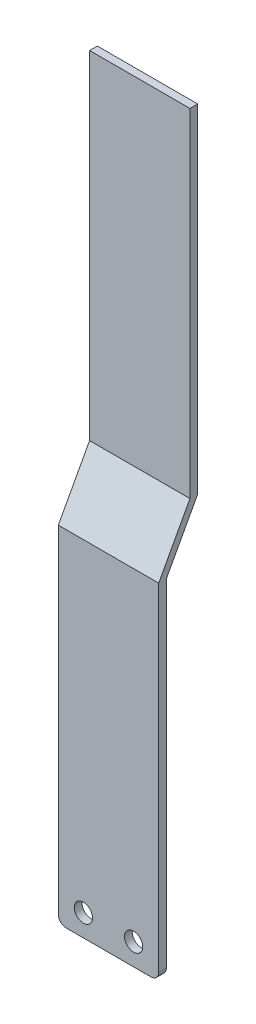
ISO-10303-21;
HEADER;
FILE_DESCRIPTION(('STEP AP214'),'2;1');
FILE_NAME('part.step','',(''),(''),'','','');
FILE_SCHEMA(('AUTOMOTIVE_DESIGN { 1 0 10303 214 1 1 1 1 }'));
ENDSEC;
DATA;
#1=APPLICATION_CONTEXT('core data for automotive mechanical design processes');
#2=APPLICATION_PROTOCOL_DEFINITION('international standard','automotive_design',2000,#1);
#3=PRODUCT_CONTEXT('',#1,'mechanical');
#4=PRODUCT('Part','Part','',(#3));
#5=PRODUCT_RELATED_PRODUCT_CATEGORY('part','',(#4));
#6=PRODUCT_DEFINITION_FORMATION('','',#4);
#7=PRODUCT_DEFINITION_CONTEXT('part definition',#1,'design');
#8=PRODUCT_DEFINITION('design','',#6,#7);
#9=PRODUCT_DEFINITION_SHAPE('','',#8);
#10=(LENGTH_UNIT() NAMED_UNIT(*) SI_UNIT(.MILLI.,.METRE.));
#11=(NAMED_UNIT(*) PLANE_ANGLE_UNIT() SI_UNIT($,.RADIAN.));
#12=(NAMED_UNIT(*) SI_UNIT($,.STERADIAN.) SOLID_ANGLE_UNIT());
#13=UNCERTAINTY_MEASURE_WITH_UNIT(LENGTH_MEASURE(1.E-05),#10,'distance_accuracy_value','');
#14=(GEOMETRIC_REPRESENTATION_CONTEXT(3) GLOBAL_UNCERTAINTY_ASSIGNED_CONTEXT((#13)) GLOBAL_UNIT_ASSIGNED_CONTEXT((#10,
#11,#12)) REPRESENTATION_CONTEXT('',''));
#15=CARTESIAN_POINT('',(0.,0.,0.));
#16=DIRECTION('',(0.,0.,1.));
#17=DIRECTION('',(1.,0.,0.));
#18=AXIS2_PLACEMENT_3D('',#15,#16,#17);
#19=CARTESIAN_POINT('',(14.3366294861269,40.9401523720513,2.54));
#20=DIRECTION('',(0.,0.,1.));
#21=DIRECTION('',(1.,0.,0.));
#22=AXIS2_PLACEMENT_3D('',#19,#20,#21);
#23=PLANE('',#22);
#24=CARTESIAN_POINT('',(-7.87762606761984,45.5871490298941,2.54));
#25=DIRECTION('',(0.,0.,1.));
#26=DIRECTION('',(1.,0.,0.));
#27=AXIS2_PLACEMENT_3D('',#24,#25,#26);
#28=CIRCLE('',#27,2.99251043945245);
#29=CARTESIAN_POINT('',(-4.88511562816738,45.5871490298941,2.54));
#30=VERTEX_POINT('',#29);
#31=EDGE_CURVE('E122',#30,#30,#28,.T.);
#32=ORIENTED_EDGE('',*,*,#31,.F.);
#33=EDGE_LOOP('',(#32));
#34=FACE_BOUND('',#33,.T.);
#35=DIRECTION('',(-1.,0.,0.));
#36=VECTOR('',#35,1.);
#37=CARTESIAN_POINT('',(-16.1290445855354,151.804902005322,2.54));
#38=LINE('',#37,#36);
#39=CARTESIAN_POINT('',(16.8766294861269,151.804902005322,2.54));
#40=VERTEX_POINT('',#39);
#41=CARTESIAN_POINT('',(-16.1290445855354,151.804902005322,2.54));
#42=VERTEX_POINT('',#41);
#43=EDGE_CURVE('E130',#40,#42,#38,.T.);
#44=ORIENTED_EDGE('',*,*,#43,.T.);
#45=DIRECTION('',(0.,-1.,0.));
#46=VECTOR('',#45,1.);
#47=CARTESIAN_POINT('',(-16.1290445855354,49.4355577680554,2.54));
#48=LINE('',#47,#46);
#49=CARTESIAN_POINT('',(-16.1290445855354,40.9401523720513,2.54));
#50=VERTEX_POINT('',#49);
#51=EDGE_CURVE('E88',#42,#50,#48,.T.);
#52=ORIENTED_EDGE('',*,*,#51,.T.);
#53=CARTESIAN_POINT('',(-13.5890445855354,40.9401523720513,2.54));
#54=DIRECTION('',(0.,0.,1.));
#55=DIRECTION('',(1.,0.,0.));
#56=AXIS2_PLACEMENT_3D('',#53,#54,#55);
#57=CIRCLE('',#56,2.54);
#58=CARTESIAN_POINT('',(-13.5890445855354,38.4001523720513,2.54));
#59=VERTEX_POINT('',#58);
#60=EDGE_CURVE('E104',#50,#59,#57,.T.);
#61=ORIENTED_EDGE('',*,*,#60,.T.);
#62=DIRECTION('',(1.,0.,0.));
#63=VECTOR('',#62,1.);
#64=CARTESIAN_POINT('',(-13.5890445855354,38.4001523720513,2.54));
#65=LINE('',#64,#63);
#66=CARTESIAN_POINT('',(14.3366294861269,38.4001523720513,2.54));
#67=VERTEX_POINT('',#66);
#68=EDGE_CURVE('E98',#59,#67,#65,.T.);
#69=ORIENTED_EDGE('',*,*,#68,.T.);
#70=CARTESIAN_POINT('',(14.3366294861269,40.9401523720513,2.54));
#71=DIRECTION('',(0.,0.,1.));
#72=DIRECTION('',(1.,0.,0.));
#73=AXIS2_PLACEMENT_3D('',#70,#71,#72);
#74=CIRCLE('',#73,2.54);
#75=CARTESIAN_POINT('',(16.8766294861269,40.9401523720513,2.54));
#76=VERTEX_POINT('',#75);
#77=EDGE_CURVE('E101',#67,#76,#74,.T.);
#78=ORIENTED_EDGE('',*,*,#77,.T.);
#79=DIRECTION('',(0.,1.,0.));
#80=VECTOR('',#79,1.);
#81=CARTESIAN_POINT('',(16.8766294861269,40.9401523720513,2.54));
#82=LINE('',#81,#80);
#83=EDGE_CURVE('E50',#76,#40,#82,.T.);
#84=ORIENTED_EDGE('',*,*,#83,.T.);
#85=EDGE_LOOP('',(#44,#52,#61,#69,#78,#84));
#86=FACE_BOUND('',#85,.T.);
#87=CARTESIAN_POINT('',(8.62521096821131,45.5871490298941,2.54));
#88=DIRECTION('',(0.,0.,1.));
#89=DIRECTION('',(1.,0.,0.));
#90=AXIS2_PLACEMENT_3D('',#87,#88,#89);
#91=CIRCLE('',#90,2.99251043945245);
#92=CARTESIAN_POINT('',(11.6177214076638,45.5871490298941,2.54));
#93=VERTEX_POINT('',#92);
#94=EDGE_CURVE('E176',#93,#93,#91,.T.);
#95=ORIENTED_EDGE('',*,*,#94,.F.);
#96=EDGE_LOOP('',(#95));
#97=FACE_BOUND('',#96,.T.);
#98=ADVANCED_FACE('F33',(#34,#86,#97),#23,.T.);
#99=CARTESIAN_POINT('',(14.3366294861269,40.9401523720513,0.));
#100=DIRECTION('',(0.,0.,1.));
#101=DIRECTION('',(1.,0.,0.));
#102=AXIS2_PLACEMENT_3D('',#99,#100,#101);
#103=PLANE('',#102);
#104=CARTESIAN_POINT('',(-7.87762606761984,45.5871490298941,0.));
#105=DIRECTION('',(0.,0.,1.));
#106=DIRECTION('',(1.,0.,0.));
#107=AXIS2_PLACEMENT_3D('',#104,#105,#106);
#108=CIRCLE('',#107,2.99251043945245);
#109=CARTESIAN_POINT('',(-4.88511562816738,45.5871490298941,0.));
#110=VERTEX_POINT('',#109);
#111=EDGE_CURVE('E179',#110,#110,#108,.T.);
#112=ORIENTED_EDGE('',*,*,#111,.T.);
#113=EDGE_LOOP('',(#112));
#114=FACE_BOUND('',#113,.T.);
#115=DIRECTION('',(-1.,0.,0.));
#116=VECTOR('',#115,1.);
#117=CARTESIAN_POINT('',(-16.1290445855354,151.804902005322,0.));
#118=LINE('',#117,#116);
#119=CARTESIAN_POINT('',(16.8766294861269,151.804902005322,0.));
#120=VERTEX_POINT('',#119);
#121=CARTESIAN_POINT('',(-16.1290445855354,151.804902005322,0.));
#122=VERTEX_POINT('',#121);
#123=EDGE_CURVE('E118',#120,#122,#118,.T.);
#124=ORIENTED_EDGE('',*,*,#123,.F.);
#125=DIRECTION('',(0.,1.,0.));
#126=VECTOR('',#125,1.);
#127=CARTESIAN_POINT('',(16.8766294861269,151.804902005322,0.));
#128=LINE('',#127,#126);
#129=CARTESIAN_POINT('',(16.8766294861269,40.9401523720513,0.));
#130=VERTEX_POINT('',#129);
#131=EDGE_CURVE('E79',#130,#120,#128,.T.);
#132=ORIENTED_EDGE('',*,*,#131,.F.);
#133=CARTESIAN_POINT('',(14.3366294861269,40.9401523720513,0.));
#134=DIRECTION('',(0.,0.,1.));
#135=DIRECTION('',(1.,0.,0.));
#136=AXIS2_PLACEMENT_3D('',#133,#134,#135);
#137=CIRCLE('',#136,2.54);
#138=CARTESIAN_POINT('',(14.3366294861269,38.4001523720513,0.));
#139=VERTEX_POINT('',#138);
#140=EDGE_CURVE('E127',#139,#130,#137,.T.);
#141=ORIENTED_EDGE('',*,*,#140,.F.);
#142=DIRECTION('',(1.,0.,0.));
#143=VECTOR('',#142,1.);
#144=CARTESIAN_POINT('',(-13.5890445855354,38.4001523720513,0.));
#145=LINE('',#144,#143);
#146=CARTESIAN_POINT('',(-13.5890445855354,38.4001523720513,0.));
#147=VERTEX_POINT('',#146);
#148=EDGE_CURVE('E71',#147,#139,#145,.T.);
#149=ORIENTED_EDGE('',*,*,#148,.F.);
#150=CARTESIAN_POINT('',(-13.5890445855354,40.9401523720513,0.));
#151=DIRECTION('',(0.,0.,1.));
#152=DIRECTION('',(1.,0.,0.));
#153=AXIS2_PLACEMENT_3D('',#150,#151,#152);
#154=CIRCLE('',#153,2.54);
#155=CARTESIAN_POINT('',(-16.1290445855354,40.9401523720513,0.));
#156=VERTEX_POINT('',#155);
#157=EDGE_CURVE('E124',#156,#147,#154,.T.);
#158=ORIENTED_EDGE('',*,*,#157,.F.);
#159=DIRECTION('',(0.,-1.,0.));
#160=VECTOR('',#159,1.);
#161=CARTESIAN_POINT('',(-16.1290445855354,40.9401523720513,0.));
#162=LINE('',#161,#160);
#163=EDGE_CURVE('E121',#122,#156,#162,.T.);
#164=ORIENTED_EDGE('',*,*,#163,.F.);
#165=EDGE_LOOP('',(#124,#132,#141,#149,#158,#164));
#166=FACE_BOUND('',#165,.T.);
#167=CARTESIAN_POINT('',(8.62521096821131,45.5871490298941,0.));
#168=DIRECTION('',(0.,0.,1.));
#169=DIRECTION('',(1.,0.,0.));
#170=AXIS2_PLACEMENT_3D('',#167,#168,#169);
#171=CIRCLE('',#170,2.99251043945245);
#172=CARTESIAN_POINT('',(11.6177214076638,45.5871490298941,0.));
#173=VERTEX_POINT('',#172);
#174=EDGE_CURVE('E166',#173,#173,#171,.T.);
#175=ORIENTED_EDGE('',*,*,#174,.T.);
#176=EDGE_LOOP('',(#175));
#177=FACE_BOUND('',#176,.T.);
#178=ADVANCED_FACE('F133',(#114,#166,#177),#103,.F.);
#179=CARTESIAN_POINT('',(-16.1290445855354,40.9401523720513,2.54));
#180=DIRECTION('',(1.,0.,0.));
#181=DIRECTION('',(0.,1.,0.));
#182=AXIS2_PLACEMENT_3D('',#179,#180,#181);
#183=PLANE('',#182);
#184=ORIENTED_EDGE('',*,*,#163,.T.);
#185=DIRECTION('',(0.,0.,-1.));
#186=VECTOR('',#185,1.);
#187=CARTESIAN_POINT('',(-16.1290445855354,40.9401523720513,2.54));
#188=LINE('',#187,#186);
#189=EDGE_CURVE('E11',#50,#156,#188,.T.);
#190=ORIENTED_EDGE('',*,*,#189,.F.);
#191=ORIENTED_EDGE('',*,*,#51,.F.);
#192=DIRECTION('',(0.,-0.878888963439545,0.477026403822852));
#193=VECTOR('',#192,1.);
#194=CARTESIAN_POINT('',(-16.1290445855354,151.804902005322,2.54));
#195=LINE('',#194,#193);
#196=CARTESIAN_POINT('',(-16.1290445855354,170.743713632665,-7.73924297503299));
#197=VERTEX_POINT('',#196);
#198=EDGE_CURVE('E162',#197,#42,#195,.T.);
#199=ORIENTED_EDGE('',*,*,#198,.F.);
#200=DIRECTION('',(0.,-1.,0.));
#201=VECTOR('',#200,1.);
#202=CARTESIAN_POINT('',(-16.1290445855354,170.743713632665,-7.73924297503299));
#203=LINE('',#202,#201);
#204=CARTESIAN_POINT('',(-16.1290445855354,281.828072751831,-7.73924297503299));
#205=VERTEX_POINT('',#204);
#206=EDGE_CURVE('E154',#205,#197,#203,.T.);
#207=ORIENTED_EDGE('',*,*,#206,.F.);
#208=DIRECTION('',(0.,0.,1.));
#209=VECTOR('',#208,1.);
#210=CARTESIAN_POINT('',(-16.1290445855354,281.828072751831,-10.2792429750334));
#211=LINE('',#210,#209);
#212=CARTESIAN_POINT('',(-16.1290445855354,281.828072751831,-10.2792429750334));
#213=VERTEX_POINT('',#212);
#214=EDGE_CURVE('E355',#213,#205,#211,.T.);
#215=ORIENTED_EDGE('',*,*,#214,.F.);
#216=DIRECTION('',(0.,1.,0.));
#217=VECTOR('',#216,1.);
#218=CARTESIAN_POINT('',(-16.1290445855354,170.743713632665,-10.2792429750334));
#219=LINE('',#218,#217);
#220=CARTESIAN_POINT('',(-16.1290445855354,170.743713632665,-10.2792429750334));
#221=VERTEX_POINT('',#220);
#222=EDGE_CURVE('E356',#221,#213,#219,.T.);
#223=ORIENTED_EDGE('',*,*,#222,.F.);
#224=DIRECTION('',(0.,0.878888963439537,-0.477026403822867));
#225=VECTOR('',#224,1.);
#226=CARTESIAN_POINT('',(-16.1290445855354,151.804902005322,0.));
#227=LINE('',#226,#225);
#228=EDGE_CURVE('E353',#122,#221,#227,.T.);
#229=ORIENTED_EDGE('',*,*,#228,.F.);
#230=EDGE_LOOP('',(#184,#190,#191,#199,#207,#215,#223,#229));
#231=FACE_BOUND('',#230,.T.);
#232=ADVANCED_FACE('F35',(#231),#183,.F.);
#233=CARTESIAN_POINT('',(-13.5890445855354,40.9401523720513,2.54));
#234=DIRECTION('',(0.,0.,-1.));
#235=DIRECTION('',(-1.,0.,0.));
#236=AXIS2_PLACEMENT_3D('',#233,#234,#235);
#237=CYLINDRICAL_SURFACE('',#236,2.54);
#238=ORIENTED_EDGE('',*,*,#157,.T.);
#239=DIRECTION('',(0.,0.,-1.));
#240=VECTOR('',#239,1.);
#241=CARTESIAN_POINT('',(-13.5890445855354,38.4001523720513,2.54));
#242=LINE('',#241,#240);
#243=EDGE_CURVE('E42',#59,#147,#242,.T.);
#244=ORIENTED_EDGE('',*,*,#243,.F.);
#245=ORIENTED_EDGE('',*,*,#60,.F.);
#246=ORIENTED_EDGE('',*,*,#189,.T.);
#247=EDGE_LOOP('',(#238,#244,#245,#246));
#248=FACE_BOUND('',#247,.T.);
#249=ADVANCED_FACE('F189',(#248),#237,.T.);
#250=CARTESIAN_POINT('',(-13.5890445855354,38.4001523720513,2.54));
#251=DIRECTION('',(0.,1.,0.));
#252=DIRECTION('',(0.,0.,1.));
#253=AXIS2_PLACEMENT_3D('',#250,#251,#252);
#254=PLANE('',#253);
#255=ORIENTED_EDGE('',*,*,#148,.T.);
#256=DIRECTION('',(0.,0.,-1.));
#257=VECTOR('',#256,1.);
#258=CARTESIAN_POINT('',(14.3366294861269,38.4001523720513,2.54));
#259=LINE('',#258,#257);
#260=EDGE_CURVE('E107',#67,#139,#259,.T.);
#261=ORIENTED_EDGE('',*,*,#260,.F.);
#262=ORIENTED_EDGE('',*,*,#68,.F.);
#263=ORIENTED_EDGE('',*,*,#243,.T.);
#264=EDGE_LOOP('',(#255,#261,#262,#263));
#265=FACE_BOUND('',#264,.T.);
#266=ADVANCED_FACE('F108',(#265),#254,.F.);
#267=CARTESIAN_POINT('',(14.3366294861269,40.9401523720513,2.54));
#268=DIRECTION('',(0.,0.,-1.));
#269=DIRECTION('',(-1.,0.,0.));
#270=AXIS2_PLACEMENT_3D('',#267,#268,#269);
#271=CYLINDRICAL_SURFACE('',#270,2.54);
#272=ORIENTED_EDGE('',*,*,#140,.T.);
#273=DIRECTION('',(0.,0.,-1.));
#274=VECTOR('',#273,1.);
#275=CARTESIAN_POINT('',(16.8766294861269,40.9401523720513,2.54));
#276=LINE('',#275,#274);
#277=EDGE_CURVE('E110',#76,#130,#276,.T.);
#278=ORIENTED_EDGE('',*,*,#277,.F.);
#279=ORIENTED_EDGE('',*,*,#77,.F.);
#280=ORIENTED_EDGE('',*,*,#260,.T.);
#281=EDGE_LOOP('',(#272,#278,#279,#280));
#282=FACE_BOUND('',#281,.T.);
#283=ADVANCED_FACE('F112',(#282),#271,.T.);
#284=CARTESIAN_POINT('',(16.8766294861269,151.804902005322,2.54));
#285=DIRECTION('',(-1.,0.,0.));
#286=DIRECTION('',(0.,-1.,0.));
#287=AXIS2_PLACEMENT_3D('',#284,#285,#286);
#288=PLANE('',#287);
#289=ORIENTED_EDGE('',*,*,#131,.T.);
#290=DIRECTION('',(0.,0.878888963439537,-0.477026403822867));
#291=VECTOR('',#290,1.);
#292=CARTESIAN_POINT('',(16.8766294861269,151.804902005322,0.));
#293=LINE('',#292,#291);
#294=CARTESIAN_POINT('',(16.8766294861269,170.743713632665,-10.2792429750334));
#295=VERTEX_POINT('',#294);
#296=EDGE_CURVE('E149',#120,#295,#293,.T.);
#297=ORIENTED_EDGE('',*,*,#296,.T.);
#298=DIRECTION('',(0.,1.,0.));
#299=VECTOR('',#298,1.);
#300=CARTESIAN_POINT('',(16.8766294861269,170.743713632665,-10.2792429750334));
#301=LINE('',#300,#299);
#302=CARTESIAN_POINT('',(16.8766294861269,281.828072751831,-10.2792429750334));
#303=VERTEX_POINT('',#302);
#304=EDGE_CURVE('E151',#295,#303,#301,.T.);
#305=ORIENTED_EDGE('',*,*,#304,.T.);
#306=DIRECTION('',(0.,0.,1.));
#307=VECTOR('',#306,1.);
#308=CARTESIAN_POINT('',(16.8766294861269,281.828072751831,-10.2792429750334));
#309=LINE('',#308,#307);
#310=CARTESIAN_POINT('',(16.8766294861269,281.828072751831,-7.73924297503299));
#311=VERTEX_POINT('',#310);
#312=EDGE_CURVE('E159',#303,#311,#309,.T.);
#313=ORIENTED_EDGE('',*,*,#312,.T.);
#314=DIRECTION('',(0.,-1.,0.));
#315=VECTOR('',#314,1.);
#316=CARTESIAN_POINT('',(16.8766294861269,170.743713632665,-7.73924297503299));
#317=LINE('',#316,#315);
#318=CARTESIAN_POINT('',(16.8766294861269,170.743713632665,-7.73924297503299));
#319=VERTEX_POINT('',#318);
#320=EDGE_CURVE('E146',#311,#319,#317,.T.);
#321=ORIENTED_EDGE('',*,*,#320,.T.);
#322=DIRECTION('',(0.,-0.878888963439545,0.477026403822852));
#323=VECTOR('',#322,1.);
#324=CARTESIAN_POINT('',(16.8766294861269,151.804902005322,2.54));
#325=LINE('',#324,#323);
#326=EDGE_CURVE('E143',#319,#40,#325,.T.);
#327=ORIENTED_EDGE('',*,*,#326,.T.);
#328=ORIENTED_EDGE('',*,*,#83,.F.);
#329=ORIENTED_EDGE('',*,*,#277,.T.);
#330=EDGE_LOOP('',(#289,#297,#305,#313,#321,#327,#328,#329));
#331=FACE_BOUND('',#330,.T.);
#332=ADVANCED_FACE('F136',(#331),#288,.F.);
#333=CARTESIAN_POINT('',(-7.87762606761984,45.5871490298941,2.54));
#334=DIRECTION('',(0.,0.,-1.));
#335=DIRECTION('',(-1.,0.,0.));
#336=AXIS2_PLACEMENT_3D('',#333,#334,#335);
#337=CYLINDRICAL_SURFACE('',#336,2.99251043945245);
#338=ORIENTED_EDGE('',*,*,#31,.T.);
#339=EDGE_LOOP('',(#338));
#340=FACE_BOUND('',#339,.T.);
#341=ORIENTED_EDGE('',*,*,#111,.F.);
#342=EDGE_LOOP('',(#341));
#343=FACE_BOUND('',#342,.T.);
#344=ADVANCED_FACE('F206',(#340,#343),#337,.F.);
#345=CARTESIAN_POINT('',(8.62521096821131,45.5871490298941,2.54));
#346=DIRECTION('',(0.,0.,-1.));
#347=DIRECTION('',(-1.,0.,0.));
#348=AXIS2_PLACEMENT_3D('',#345,#346,#347);
#349=CYLINDRICAL_SURFACE('',#348,2.99251043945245);
#350=ORIENTED_EDGE('',*,*,#94,.T.);
#351=EDGE_LOOP('',(#350));
#352=FACE_BOUND('',#351,.T.);
#353=ORIENTED_EDGE('',*,*,#174,.F.);
#354=EDGE_LOOP('',(#353));
#355=FACE_BOUND('',#354,.T.);
#356=ADVANCED_FACE('F228',(#352,#355),#349,.F.);
#357=CARTESIAN_POINT('',(-16.1290445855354,151.804902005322,2.54));
#358=DIRECTION('',(0.,0.477026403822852,0.878888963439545));
#359=DIRECTION('',(0.,-0.878888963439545,0.477026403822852));
#360=AXIS2_PLACEMENT_3D('',#357,#358,#359);
#361=PLANE('',#360);
#362=ORIENTED_EDGE('',*,*,#326,.F.);
#363=DIRECTION('',(1.,0.,0.));
#364=VECTOR('',#363,1.);
#365=CARTESIAN_POINT('',(-16.1290445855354,170.743713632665,-7.73924297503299));
#366=LINE('',#365,#364);
#367=EDGE_CURVE('E163',#197,#319,#366,.T.);
#368=ORIENTED_EDGE('',*,*,#367,.F.);
#369=ORIENTED_EDGE('',*,*,#198,.T.);
#370=ORIENTED_EDGE('',*,*,#43,.F.);
#371=EDGE_LOOP('',(#362,#368,#369,#370));
#372=FACE_BOUND('',#371,.T.);
#373=ADVANCED_FACE('F235',(#372),#361,.T.);
#374=CARTESIAN_POINT('',(-16.1290445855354,170.743713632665,-7.73924297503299));
#375=DIRECTION('',(0.,0.,1.));
#376=DIRECTION('',(1.,0.,0.));
#377=AXIS2_PLACEMENT_3D('',#374,#375,#376);
#378=PLANE('',#377);
#379=ORIENTED_EDGE('',*,*,#320,.F.);
#380=DIRECTION('',(1.,0.,0.));
#381=VECTOR('',#380,1.);
#382=CARTESIAN_POINT('',(-16.1290445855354,281.828072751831,-7.73924297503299));
#383=LINE('',#382,#381);
#384=EDGE_CURVE('E167',#205,#311,#383,.T.);
#385=ORIENTED_EDGE('',*,*,#384,.F.);
#386=ORIENTED_EDGE('',*,*,#206,.T.);
#387=ORIENTED_EDGE('',*,*,#367,.T.);
#388=EDGE_LOOP('',(#379,#385,#386,#387));
#389=FACE_BOUND('',#388,.T.);
#390=ADVANCED_FACE('F241',(#389),#378,.T.);
#391=CARTESIAN_POINT('',(-16.1290445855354,281.828072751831,-10.2792429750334));
#392=DIRECTION('',(0.,1.,0.));
#393=DIRECTION('',(-1.,0.,0.));
#394=AXIS2_PLACEMENT_3D('',#391,#392,#393);
#395=PLANE('',#394);
#396=ORIENTED_EDGE('',*,*,#312,.F.);
#397=DIRECTION('',(1.,0.,0.));
#398=VECTOR('',#397,1.);
#399=CARTESIAN_POINT('',(-16.1290445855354,281.828072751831,-10.2792429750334));
#400=LINE('',#399,#398);
#401=EDGE_CURVE('E170',#213,#303,#400,.T.);
#402=ORIENTED_EDGE('',*,*,#401,.F.);
#403=ORIENTED_EDGE('',*,*,#214,.T.);
#404=ORIENTED_EDGE('',*,*,#384,.T.);
#405=EDGE_LOOP('',(#396,#402,#403,#404));
#406=FACE_BOUND('',#405,.T.);
#407=ADVANCED_FACE('F248',(#406),#395,.T.);
#408=CARTESIAN_POINT('',(-16.1290445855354,170.743713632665,-10.2792429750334));
#409=DIRECTION('',(0.,0.,-1.));
#410=DIRECTION('',(-1.,0.,0.));
#411=AXIS2_PLACEMENT_3D('',#408,#409,#410);
#412=PLANE('',#411);
#413=ORIENTED_EDGE('',*,*,#304,.F.);
#414=DIRECTION('',(1.,0.,0.));
#415=VECTOR('',#414,1.);
#416=CARTESIAN_POINT('',(-16.1290445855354,170.743713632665,-10.2792429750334));
#417=LINE('',#416,#415);
#418=EDGE_CURVE('E173',#221,#295,#417,.T.);
#419=ORIENTED_EDGE('',*,*,#418,.F.);
#420=ORIENTED_EDGE('',*,*,#222,.T.);
#421=ORIENTED_EDGE('',*,*,#401,.T.);
#422=EDGE_LOOP('',(#413,#419,#420,#421));
#423=FACE_BOUND('',#422,.T.);
#424=ADVANCED_FACE('F256',(#423),#412,.T.);
#425=CARTESIAN_POINT('',(-16.1290445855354,151.804902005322,0.));
#426=DIRECTION('',(0.,-0.477026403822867,-0.878888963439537));
#427=DIRECTION('',(0.,0.878888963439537,-0.477026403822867));
#428=AXIS2_PLACEMENT_3D('',#425,#426,#427);
#429=PLANE('',#428);
#430=ORIENTED_EDGE('',*,*,#296,.F.);
#431=ORIENTED_EDGE('',*,*,#123,.T.);
#432=ORIENTED_EDGE('',*,*,#228,.T.);
#433=ORIENTED_EDGE('',*,*,#418,.T.);
#434=EDGE_LOOP('',(#430,#431,#432,#433));
#435=FACE_BOUND('',#434,.T.);
#436=ADVANCED_FACE('F264',(#435),#429,.T.);
#437=CLOSED_SHELL('',(#98,#178,#232,#249,#266,#283,#332,#344,#356,#373,#390,#407,#424,#436));
#438=MANIFOLD_SOLID_BREP('B2',#437);
#439=ADVANCED_BREP_SHAPE_REPRESENTATION('',(#18,#438),#14);
#440=SHAPE_DEFINITION_REPRESENTATION(#9,#439);
ENDSEC;
END-ISO-10303-21;
